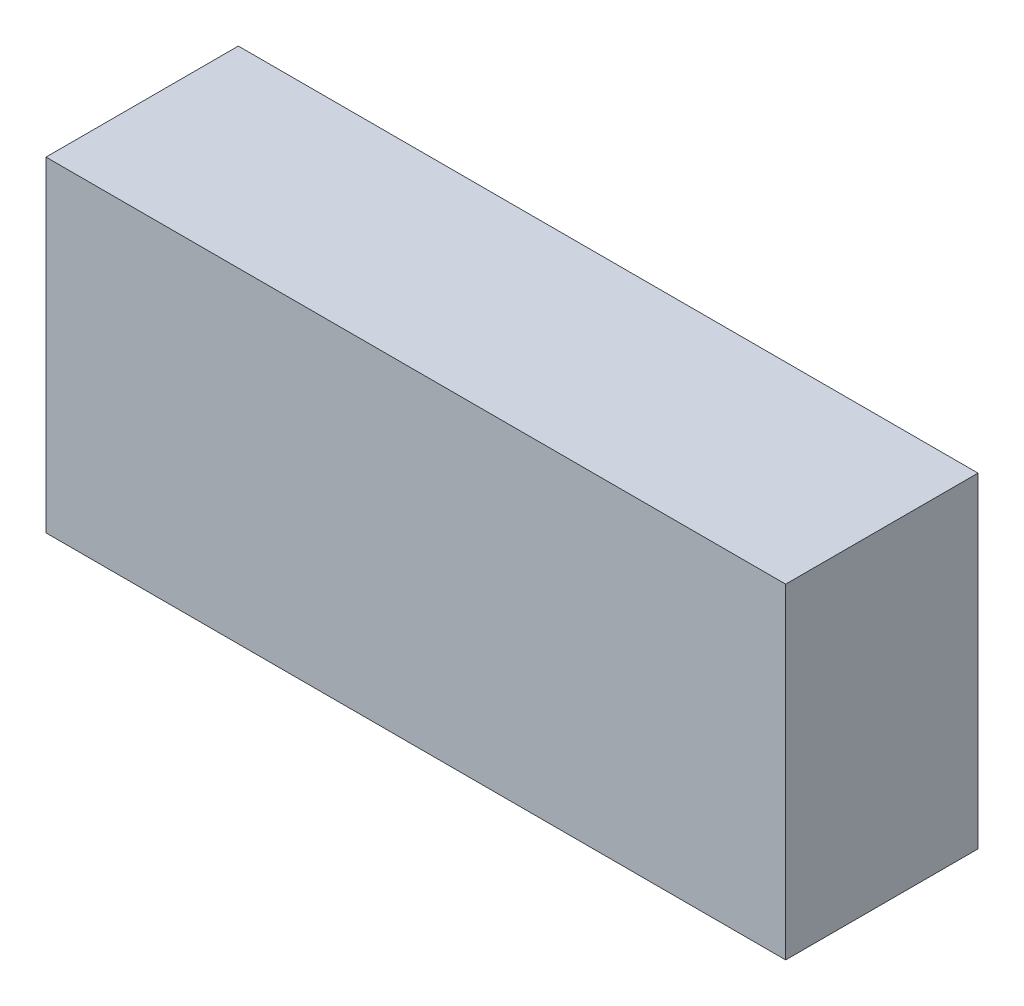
from build123d import *

# Parameters (mm, degrees)
GENERAL_W           = 2.499999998
GENERAL_H           = 1.1
BOSS_EXTRUDE1_DEPTH = 0.65


with BuildPart() as part:
    # GENERAL → Boss-Extrude1 (new body)
    with BuildSketch(Plane.XY):
        Rectangle(GENERAL_W, GENERAL_H)
    extrude(amount=BOSS_EXTRUDE1_DEPTH)


solid = part.part
